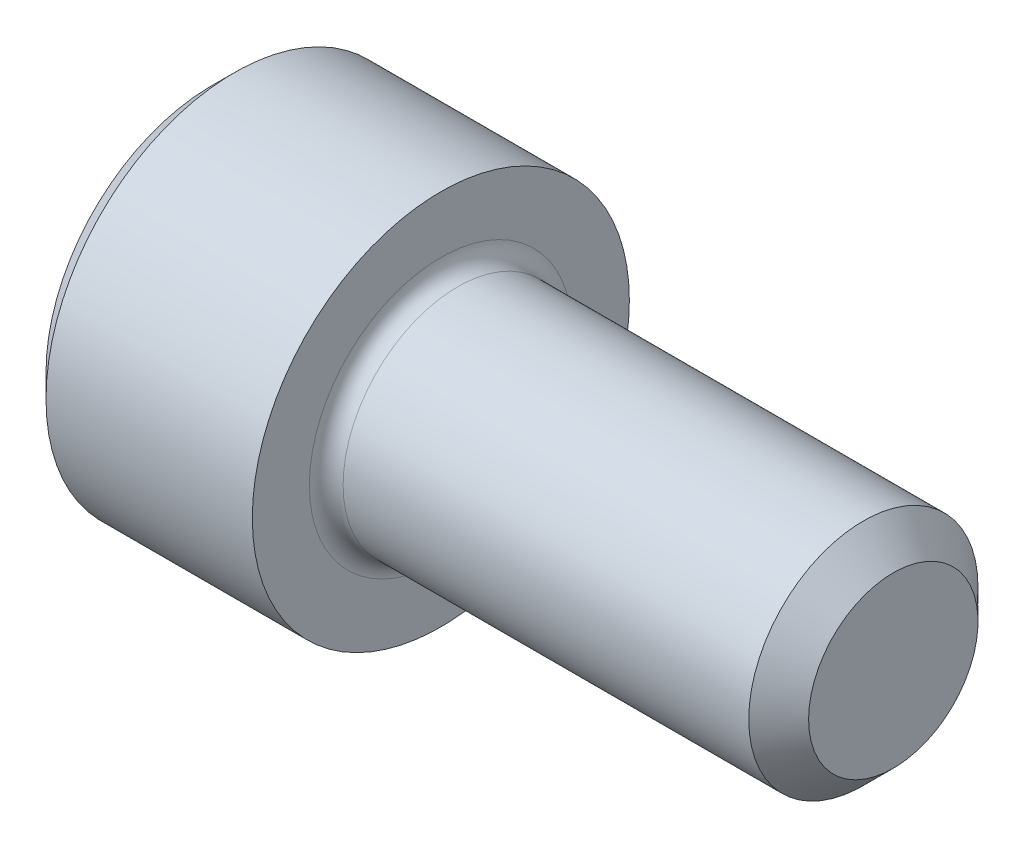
ISO-10303-21;
HEADER;
FILE_DESCRIPTION(('STEP AP214'),'2;1');
FILE_NAME('part.step','',(''),(''),'','','');
FILE_SCHEMA(('AUTOMOTIVE_DESIGN { 1 0 10303 214 1 1 1 1 }'));
ENDSEC;
DATA;
#1=APPLICATION_CONTEXT('core data for automotive mechanical design processes');
#2=APPLICATION_PROTOCOL_DEFINITION('international standard','automotive_design',2000,#1);
#3=PRODUCT_CONTEXT('',#1,'mechanical');
#4=PRODUCT('Part','Part','',(#3));
#5=PRODUCT_RELATED_PRODUCT_CATEGORY('part','',(#4));
#6=PRODUCT_DEFINITION_FORMATION('','',#4);
#7=PRODUCT_DEFINITION_CONTEXT('part definition',#1,'design');
#8=PRODUCT_DEFINITION('design','',#6,#7);
#9=PRODUCT_DEFINITION_SHAPE('','',#8);
#10=(LENGTH_UNIT() NAMED_UNIT(*) SI_UNIT(.MILLI.,.METRE.));
#11=(NAMED_UNIT(*) PLANE_ANGLE_UNIT() SI_UNIT($,.RADIAN.));
#12=(NAMED_UNIT(*) SI_UNIT($,.STERADIAN.) SOLID_ANGLE_UNIT());
#13=UNCERTAINTY_MEASURE_WITH_UNIT(LENGTH_MEASURE(1.E-05),#10,'distance_accuracy_value','');
#14=(GEOMETRIC_REPRESENTATION_CONTEXT(3) GLOBAL_UNCERTAINTY_ASSIGNED_CONTEXT((#13)) GLOBAL_UNIT_ASSIGNED_CONTEXT((#10,
#11,#12)) REPRESENTATION_CONTEXT('',''));
#15=CARTESIAN_POINT('',(0.,0.,0.));
#16=DIRECTION('',(0.,0.,1.));
#17=DIRECTION('',(1.,0.,0.));
#18=AXIS2_PLACEMENT_3D('',#15,#16,#17);
#19=CARTESIAN_POINT('',(0.,0.,0.));
#20=DIRECTION('',(-1.,0.,0.));
#21=DIRECTION('',(0.,0.,1.));
#22=AXIS2_PLACEMENT_3D('',#19,#20,#21);
#23=PLANE('',#22);
#24=DIRECTION('',(0.,-0.499999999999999,0.866025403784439));
#25=VECTOR('',#24,1.);
#26=CARTESIAN_POINT('',(0.,2.2920921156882,0.));
#27=LINE('',#26,#25);
#28=CARTESIAN_POINT('',(0.,2.2920921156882,0.));
#29=VERTEX_POINT('',#28);
#30=CARTESIAN_POINT('',(0.,1.14604605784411,1.98501));
#31=VERTEX_POINT('',#30);
#32=EDGE_CURVE('E113',#29,#31,#27,.T.);
#33=ORIENTED_EDGE('',*,*,#32,.T.);
#34=DIRECTION('',(0.,1.,0.));
#35=VECTOR('',#34,1.);
#36=CARTESIAN_POINT('',(0.,-1.14604605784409,1.98501));
#37=LINE('',#36,#35);
#38=CARTESIAN_POINT('',(0.,-1.14604605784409,1.98501));
#39=VERTEX_POINT('',#38);
#40=EDGE_CURVE('E102',#39,#31,#37,.T.);
#41=ORIENTED_EDGE('',*,*,#40,.F.);
#42=DIRECTION('',(0.,-0.500000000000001,-0.866025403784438));
#43=VECTOR('',#42,1.);
#44=CARTESIAN_POINT('',(0.,-1.14604605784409,1.98501));
#45=LINE('',#44,#43);
#46=CARTESIAN_POINT('',(0.,-2.29209211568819,0.));
#47=VERTEX_POINT('',#46);
#48=EDGE_CURVE('E112',#39,#47,#45,.T.);
#49=ORIENTED_EDGE('',*,*,#48,.T.);
#50=DIRECTION('',(0.,0.499999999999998,-0.86602540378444));
#51=VECTOR('',#50,1.);
#52=CARTESIAN_POINT('',(0.,-2.29209211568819,0.));
#53=LINE('',#52,#51);
#54=CARTESIAN_POINT('',(0.,-1.1460460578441,-1.98501));
#55=VERTEX_POINT('',#54);
#56=EDGE_CURVE('E131',#47,#55,#53,.T.);
#57=ORIENTED_EDGE('',*,*,#56,.T.);
#58=DIRECTION('',(0.,-1.,0.));
#59=VECTOR('',#58,1.);
#60=CARTESIAN_POINT('',(0.,1.1460460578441,-1.98501));
#61=LINE('',#60,#59);
#62=CARTESIAN_POINT('',(0.,1.1460460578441,-1.98501));
#63=VERTEX_POINT('',#62);
#64=EDGE_CURVE('E134',#63,#55,#61,.T.);
#65=ORIENTED_EDGE('',*,*,#64,.F.);
#66=DIRECTION('',(0.,-0.500000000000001,-0.866025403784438));
#67=VECTOR('',#66,1.);
#68=CARTESIAN_POINT('',(0.,2.2920921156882,0.));
#69=LINE('',#68,#67);
#70=EDGE_CURVE('E127',#29,#63,#69,.T.);
#71=ORIENTED_EDGE('',*,*,#70,.F.);
#72=EDGE_LOOP('',(#33,#41,#49,#57,#65,#71));
#73=FACE_BOUND('',#72,.T.);
#74=CARTESIAN_POINT('',(0.,0.,0.));
#75=DIRECTION('',(-1.,0.,0.));
#76=DIRECTION('',(0.,0.,1.));
#77=AXIS2_PLACEMENT_3D('',#74,#75,#76);
#78=CIRCLE('',#77,3.48614999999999);
#79=CARTESIAN_POINT('',(0.,0.,3.48614999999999));
#80=VERTEX_POINT('',#79);
#81=EDGE_CURVE('E172',#80,#80,#78,.T.);
#82=ORIENTED_EDGE('',*,*,#81,.T.);
#83=EDGE_LOOP('',(#82));
#84=FACE_BOUND('',#83,.T.);
#85=ADVANCED_FACE('F30',(#73,#84),#23,.T.);
#86=CARTESIAN_POINT('',(14.351,1.78308,0.));
#87=DIRECTION('',(1.,0.,0.));
#88=DIRECTION('',(0.,0.,-1.));
#89=AXIS2_PLACEMENT_3D('',#86,#87,#88);
#90=PLANE('',#89);
#91=CARTESIAN_POINT('',(14.351,0.,0.));
#92=DIRECTION('',(-1.,0.,0.));
#93=DIRECTION('',(0.,0.,1.));
#94=AXIS2_PLACEMENT_3D('',#91,#92,#93);
#95=CIRCLE('',#94,1.78308);
#96=CARTESIAN_POINT('',(14.351,0.,1.78308));
#97=VERTEX_POINT('',#96);
#98=EDGE_CURVE('E185',#97,#97,#95,.T.);
#99=ORIENTED_EDGE('',*,*,#98,.F.);
#100=EDGE_LOOP('',(#99));
#101=FACE_BOUND('',#100,.T.);
#102=ADVANCED_FACE('F32',(#101),#90,.T.);
#103=CARTESIAN_POINT('',(14.351,0.,0.));
#104=DIRECTION('',(-1.,0.,0.));
#105=DIRECTION('',(0.,0.,1.));
#106=AXIS2_PLACEMENT_3D('',#103,#104,#105);
#107=CONICAL_SURFACE('',#106,1.78308,0.785398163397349);
#108=CARTESIAN_POINT('',(13.7210799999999,0.,0.));
#109=DIRECTION('',(-1.,0.,0.));
#110=DIRECTION('',(0.,0.,1.));
#111=AXIS2_PLACEMENT_3D('',#108,#109,#110);
#112=CIRCLE('',#111,2.41299999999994);
#113=CARTESIAN_POINT('',(13.7210799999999,0.,2.41299999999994));
#114=VERTEX_POINT('',#113);
#115=EDGE_CURVE('E182',#114,#114,#112,.T.);
#116=ORIENTED_EDGE('',*,*,#115,.F.);
#117=EDGE_LOOP('',(#116));
#118=FACE_BOUND('',#117,.T.);
#119=ORIENTED_EDGE('',*,*,#98,.T.);
#120=EDGE_LOOP('',(#119));
#121=FACE_BOUND('',#120,.T.);
#122=ADVANCED_FACE('F213',(#118,#121),#107,.T.);
#123=CARTESIAN_POINT('',(-31.75,0.,0.));
#124=DIRECTION('',(-1.,0.,0.));
#125=DIRECTION('',(0.,0.,1.));
#126=AXIS2_PLACEMENT_3D('',#123,#124,#125);
#127=CYLINDRICAL_SURFACE('',#126,2.41299999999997);
#128=CARTESIAN_POINT('',(5.1816,0.,0.));
#129=DIRECTION('',(1.,0.,0.));
#130=DIRECTION('',(0.,0.,-1.));
#131=AXIS2_PLACEMENT_3D('',#128,#129,#130);
#132=CIRCLE('',#131,2.41299999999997);
#133=CARTESIAN_POINT('',(5.1816,0.,-2.41299999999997));
#134=VERTEX_POINT('',#133);
#135=EDGE_CURVE('E11',#134,#134,#132,.T.);
#136=ORIENTED_EDGE('',*,*,#135,.T.);
#137=EDGE_LOOP('',(#136));
#138=FACE_BOUND('',#137,.T.);
#139=ORIENTED_EDGE('',*,*,#115,.T.);
#140=EDGE_LOOP('',(#139));
#141=FACE_BOUND('',#140,.T.);
#142=ADVANCED_FACE('F221',(#138,#141),#127,.T.);
#143=CARTESIAN_POINT('',(4.826,3.96875,0.));
#144=DIRECTION('',(1.,0.,0.));
#145=DIRECTION('',(0.,0.,-1.));
#146=AXIS2_PLACEMENT_3D('',#143,#144,#145);
#147=PLANE('',#146);
#148=CARTESIAN_POINT('',(4.826,0.,0.));
#149=DIRECTION('',(1.,0.,0.));
#150=DIRECTION('',(0.,0.,-1.));
#151=AXIS2_PLACEMENT_3D('',#148,#149,#150);
#152=CIRCLE('',#151,2.76859999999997);
#153=CARTESIAN_POINT('',(4.826,0.,-2.76859999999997));
#154=VERTEX_POINT('',#153);
#155=EDGE_CURVE('E38',#154,#154,#152,.F.);
#156=ORIENTED_EDGE('',*,*,#155,.T.);
#157=EDGE_LOOP('',(#156));
#158=FACE_BOUND('',#157,.T.);
#159=CARTESIAN_POINT('',(4.826,0.,0.));
#160=DIRECTION('',(-1.,0.,0.));
#161=DIRECTION('',(0.,0.,1.));
#162=AXIS2_PLACEMENT_3D('',#159,#160,#161);
#163=CIRCLE('',#162,3.96875);
#164=CARTESIAN_POINT('',(4.826,0.,3.96875));
#165=VERTEX_POINT('',#164);
#166=EDGE_CURVE('E179',#165,#165,#163,.T.);
#167=ORIENTED_EDGE('',*,*,#166,.F.);
#168=EDGE_LOOP('',(#167));
#169=FACE_BOUND('',#168,.T.);
#170=ADVANCED_FACE('F190',(#158,#169),#147,.T.);
#171=CARTESIAN_POINT('',(-31.75,0.,0.));
#172=DIRECTION('',(-1.,0.,0.));
#173=DIRECTION('',(0.,0.,1.));
#174=AXIS2_PLACEMENT_3D('',#171,#172,#173);
#175=CYLINDRICAL_SURFACE('',#174,3.96875);
#176=ORIENTED_EDGE('',*,*,#166,.T.);
#177=EDGE_LOOP('',(#176));
#178=FACE_BOUND('',#177,.T.);
#179=CARTESIAN_POINT('',(0.4826,0.,0.));
#180=DIRECTION('',(-1.,0.,0.));
#181=DIRECTION('',(0.,0.,1.));
#182=AXIS2_PLACEMENT_3D('',#179,#180,#181);
#183=CIRCLE('',#182,3.96875);
#184=CARTESIAN_POINT('',(0.4826,0.,3.96875));
#185=VERTEX_POINT('',#184);
#186=EDGE_CURVE('E176',#185,#185,#183,.T.);
#187=ORIENTED_EDGE('',*,*,#186,.F.);
#188=EDGE_LOOP('',(#187));
#189=FACE_BOUND('',#188,.T.);
#190=ADVANCED_FACE('F203',(#178,#189),#175,.T.);
#191=CARTESIAN_POINT('',(0.,0.,0.));
#192=DIRECTION('',(1.,0.,0.));
#193=DIRECTION('',(0.,0.,-1.));
#194=AXIS2_PLACEMENT_3D('',#191,#192,#193);
#195=CONICAL_SURFACE('',#194,3.48614999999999,0.785398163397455);
#196=ORIENTED_EDGE('',*,*,#186,.T.);
#197=EDGE_LOOP('',(#196));
#198=FACE_BOUND('',#197,.T.);
#199=ORIENTED_EDGE('',*,*,#81,.F.);
#200=EDGE_LOOP('',(#199));
#201=FACE_BOUND('',#200,.T.);
#202=ADVANCED_FACE('F195',(#198,#201),#195,.T.);
#203=CARTESIAN_POINT('',(5.1816,0.,0.));
#204=DIRECTION('',(1.,0.,0.));
#205=DIRECTION('',(0.,0.,-1.));
#206=AXIS2_PLACEMENT_3D('',#203,#204,#205);
#207=TOROIDAL_SURFACE('',#206,2.76859999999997,0.3556);
#208=ORIENTED_EDGE('',*,*,#135,.F.);
#209=EDGE_LOOP('',(#208));
#210=FACE_BOUND('',#209,.T.);
#211=ORIENTED_EDGE('',*,*,#155,.F.);
#212=EDGE_LOOP('',(#211));
#213=FACE_BOUND('',#212,.T.);
#214=ADVANCED_FACE('F193',(#210,#213),#207,.F.);
#215=CARTESIAN_POINT('',(2.286,2.2920921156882,0.));
#216=DIRECTION('',(0.,-0.866025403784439,-0.499999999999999));
#217=DIRECTION('',(0.,0.499999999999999,-0.866025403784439));
#218=AXIS2_PLACEMENT_3D('',#215,#216,#217);
#219=PLANE('',#218);
#220=ORIENTED_EDGE('',*,*,#32,.F.);
#221=DIRECTION('',(-1.,0.,0.));
#222=VECTOR('',#221,1.);
#223=CARTESIAN_POINT('',(2.286,2.2920921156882,0.));
#224=LINE('',#223,#222);
#225=CARTESIAN_POINT('',(2.286,2.2920921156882,0.));
#226=VERTEX_POINT('',#225);
#227=EDGE_CURVE('E157',#226,#29,#224,.T.);
#228=ORIENTED_EDGE('',*,*,#227,.F.);
#229=DIRECTION('',(0.,-0.499999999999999,0.866025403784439));
#230=VECTOR('',#229,1.);
#231=CARTESIAN_POINT('',(2.286,2.2920921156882,0.));
#232=LINE('',#231,#230);
#233=CARTESIAN_POINT('',(2.286,1.71906908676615,0.992504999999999));
#234=VERTEX_POINT('',#233);
#235=EDGE_CURVE('E137',#226,#234,#232,.T.);
#236=ORIENTED_EDGE('',*,*,#235,.T.);
#237=CARTESIAN_POINT('',(2.286,1.14604605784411,1.98501));
#238=VERTEX_POINT('',#237);
#239=EDGE_CURVE('E121',#234,#238,#232,.T.);
#240=ORIENTED_EDGE('',*,*,#239,.T.);
#241=DIRECTION('',(-1.,0.,0.));
#242=VECTOR('',#241,1.);
#243=CARTESIAN_POINT('',(2.286,1.14604605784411,1.98501));
#244=LINE('',#243,#242);
#245=EDGE_CURVE('E106',#238,#31,#244,.T.);
#246=ORIENTED_EDGE('',*,*,#245,.T.);
#247=EDGE_LOOP('',(#220,#228,#236,#240,#246));
#248=FACE_BOUND('',#247,.T.);
#249=ADVANCED_FACE('F117',(#248),#219,.T.);
#250=CARTESIAN_POINT('',(2.286,-1.14604605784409,1.98501));
#251=DIRECTION('',(0.,0.,1.));
#252=DIRECTION('',(0.,-1.,0.));
#253=AXIS2_PLACEMENT_3D('',#250,#251,#252);
#254=PLANE('',#253);
#255=ORIENTED_EDGE('',*,*,#40,.T.);
#256=ORIENTED_EDGE('',*,*,#245,.F.);
#257=DIRECTION('',(0.,1.,0.));
#258=VECTOR('',#257,1.);
#259=CARTESIAN_POINT('',(2.286,-1.14604605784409,1.98501));
#260=LINE('',#259,#258);
#261=CARTESIAN_POINT('',(2.286,0.,1.98501));
#262=VERTEX_POINT('',#261);
#263=EDGE_CURVE('E139',#262,#238,#260,.T.);
#264=ORIENTED_EDGE('',*,*,#263,.F.);
#265=CARTESIAN_POINT('',(2.286,-1.14604605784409,1.98501));
#266=VERTEX_POINT('',#265);
#267=EDGE_CURVE('E140',#266,#262,#260,.T.);
#268=ORIENTED_EDGE('',*,*,#267,.F.);
#269=DIRECTION('',(-1.,0.,0.));
#270=VECTOR('',#269,1.);
#271=CARTESIAN_POINT('',(2.286,-1.14604605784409,1.98501));
#272=LINE('',#271,#270);
#273=EDGE_CURVE('E108',#266,#39,#272,.T.);
#274=ORIENTED_EDGE('',*,*,#273,.T.);
#275=EDGE_LOOP('',(#255,#256,#264,#268,#274));
#276=FACE_BOUND('',#275,.T.);
#277=ADVANCED_FACE('F104',(#276),#254,.F.);
#278=CARTESIAN_POINT('',(2.286,-1.14604605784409,1.98501));
#279=DIRECTION('',(0.,0.866025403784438,-0.500000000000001));
#280=DIRECTION('',(0.,0.500000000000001,0.866025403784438));
#281=AXIS2_PLACEMENT_3D('',#278,#279,#280);
#282=PLANE('',#281);
#283=ORIENTED_EDGE('',*,*,#48,.F.);
#284=ORIENTED_EDGE('',*,*,#273,.F.);
#285=DIRECTION('',(0.,-0.500000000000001,-0.866025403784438));
#286=VECTOR('',#285,1.);
#287=CARTESIAN_POINT('',(2.286,-1.14604605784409,1.98501));
#288=LINE('',#287,#286);
#289=CARTESIAN_POINT('',(2.286,-1.71906908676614,0.992504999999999));
#290=VERTEX_POINT('',#289);
#291=EDGE_CURVE('E144',#266,#290,#288,.T.);
#292=ORIENTED_EDGE('',*,*,#291,.T.);
#293=CARTESIAN_POINT('',(2.286,-2.29209211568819,0.));
#294=VERTEX_POINT('',#293);
#295=EDGE_CURVE('E143',#290,#294,#288,.T.);
#296=ORIENTED_EDGE('',*,*,#295,.T.);
#297=DIRECTION('',(-1.,0.,0.));
#298=VECTOR('',#297,1.);
#299=CARTESIAN_POINT('',(2.286,-2.29209211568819,0.));
#300=LINE('',#299,#298);
#301=EDGE_CURVE('E165',#294,#47,#300,.T.);
#302=ORIENTED_EDGE('',*,*,#301,.T.);
#303=EDGE_LOOP('',(#283,#284,#292,#296,#302));
#304=FACE_BOUND('',#303,.T.);
#305=ADVANCED_FACE('F284',(#304),#282,.T.);
#306=CARTESIAN_POINT('',(2.286,-2.29209211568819,0.));
#307=DIRECTION('',(0.,0.86602540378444,0.499999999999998));
#308=DIRECTION('',(0.,-0.499999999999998,0.86602540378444));
#309=AXIS2_PLACEMENT_3D('',#306,#307,#308);
#310=PLANE('',#309);
#311=ORIENTED_EDGE('',*,*,#56,.F.);
#312=ORIENTED_EDGE('',*,*,#301,.F.);
#313=DIRECTION('',(0.,0.499999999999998,-0.86602540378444));
#314=VECTOR('',#313,1.);
#315=CARTESIAN_POINT('',(2.286,-2.29209211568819,0.));
#316=LINE('',#315,#314);
#317=CARTESIAN_POINT('',(2.286,-1.71906908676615,-0.992504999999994));
#318=VERTEX_POINT('',#317);
#319=EDGE_CURVE('E148',#294,#318,#316,.T.);
#320=ORIENTED_EDGE('',*,*,#319,.T.);
#321=CARTESIAN_POINT('',(2.286,-1.1460460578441,-1.98501));
#322=VERTEX_POINT('',#321);
#323=EDGE_CURVE('E147',#318,#322,#316,.T.);
#324=ORIENTED_EDGE('',*,*,#323,.T.);
#325=DIRECTION('',(-1.,0.,0.));
#326=VECTOR('',#325,1.);
#327=CARTESIAN_POINT('',(2.286,-1.1460460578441,-1.98501));
#328=LINE('',#327,#326);
#329=EDGE_CURVE('E162',#322,#55,#328,.T.);
#330=ORIENTED_EDGE('',*,*,#329,.T.);
#331=EDGE_LOOP('',(#311,#312,#320,#324,#330));
#332=FACE_BOUND('',#331,.T.);
#333=ADVANCED_FACE('F292',(#332),#310,.T.);
#334=CARTESIAN_POINT('',(2.286,1.1460460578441,-1.98501));
#335=DIRECTION('',(0.,0.,-1.));
#336=DIRECTION('',(0.,1.,0.));
#337=AXIS2_PLACEMENT_3D('',#334,#335,#336);
#338=PLANE('',#337);
#339=ORIENTED_EDGE('',*,*,#64,.T.);
#340=ORIENTED_EDGE('',*,*,#329,.F.);
#341=DIRECTION('',(0.,-1.,0.));
#342=VECTOR('',#341,1.);
#343=CARTESIAN_POINT('',(2.286,1.1460460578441,-1.98501));
#344=LINE('',#343,#342);
#345=CARTESIAN_POINT('',(2.286,0.,-1.98501));
#346=VERTEX_POINT('',#345);
#347=EDGE_CURVE('E151',#346,#322,#344,.T.);
#348=ORIENTED_EDGE('',*,*,#347,.F.);
#349=CARTESIAN_POINT('',(2.286,1.1460460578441,-1.98501));
#350=VERTEX_POINT('',#349);
#351=EDGE_CURVE('E45',#350,#346,#344,.T.);
#352=ORIENTED_EDGE('',*,*,#351,.F.);
#353=DIRECTION('',(-1.,0.,0.));
#354=VECTOR('',#353,1.);
#355=CARTESIAN_POINT('',(2.286,1.1460460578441,-1.98501));
#356=LINE('',#355,#354);
#357=EDGE_CURVE('E159',#350,#63,#356,.T.);
#358=ORIENTED_EDGE('',*,*,#357,.T.);
#359=EDGE_LOOP('',(#339,#340,#348,#352,#358));
#360=FACE_BOUND('',#359,.T.);
#361=ADVANCED_FACE('F301',(#360),#338,.F.);
#362=CARTESIAN_POINT('',(2.286,2.2920921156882,0.));
#363=DIRECTION('',(0.,0.866025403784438,-0.500000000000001));
#364=DIRECTION('',(0.,0.500000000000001,0.866025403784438));
#365=AXIS2_PLACEMENT_3D('',#362,#363,#364);
#366=PLANE('',#365);
#367=ORIENTED_EDGE('',*,*,#70,.T.);
#368=ORIENTED_EDGE('',*,*,#357,.F.);
#369=DIRECTION('',(0.,-0.500000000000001,-0.866025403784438));
#370=VECTOR('',#369,1.);
#371=CARTESIAN_POINT('',(2.286,2.2920921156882,0.));
#372=LINE('',#371,#370);
#373=CARTESIAN_POINT('',(2.286,1.71906908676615,-0.992505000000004));
#374=VERTEX_POINT('',#373);
#375=EDGE_CURVE('E153',#374,#350,#372,.T.);
#376=ORIENTED_EDGE('',*,*,#375,.F.);
#377=EDGE_CURVE('E154',#226,#374,#372,.T.);
#378=ORIENTED_EDGE('',*,*,#377,.F.);
#379=ORIENTED_EDGE('',*,*,#227,.T.);
#380=EDGE_LOOP('',(#367,#368,#376,#378,#379));
#381=FACE_BOUND('',#380,.T.);
#382=ADVANCED_FACE('F310',(#381),#366,.F.);
#383=CARTESIAN_POINT('',(2.286,3.4381381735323,-1.98501));
#384=DIRECTION('',(1.,0.,0.));
#385=DIRECTION('',(0.,0.,-1.));
#386=AXIS2_PLACEMENT_3D('',#383,#384,#385);
#387=PLANE('',#386);
#388=ORIENTED_EDGE('',*,*,#347,.T.);
#389=ORIENTED_EDGE('',*,*,#323,.F.);
#390=CARTESIAN_POINT('',(2.286,0.,0.));
#391=DIRECTION('',(-1.,0.,0.));
#392=DIRECTION('',(0.,0.,1.));
#393=AXIS2_PLACEMENT_3D('',#390,#391,#392);
#394=CIRCLE('',#393,1.98501);
#395=EDGE_CURVE('E390',#346,#318,#394,.T.);
#396=ORIENTED_EDGE('',*,*,#395,.F.);
#397=EDGE_LOOP('',(#388,#389,#396));
#398=FACE_BOUND('',#397,.T.);
#399=ADVANCED_FACE('F319',(#398),#387,.F.);
#400=ORIENTED_EDGE('',*,*,#319,.F.);
#401=ORIENTED_EDGE('',*,*,#295,.F.);
#402=EDGE_CURVE('E393',#318,#290,#394,.T.);
#403=ORIENTED_EDGE('',*,*,#402,.F.);
#404=EDGE_LOOP('',(#400,#401,#403));
#405=FACE_BOUND('',#404,.T.);
#406=ADVANCED_FACE('F328',(#405),#387,.F.);
#407=ORIENTED_EDGE('',*,*,#291,.F.);
#408=ORIENTED_EDGE('',*,*,#267,.T.);
#409=EDGE_CURVE('E122',#290,#262,#394,.T.);
#410=ORIENTED_EDGE('',*,*,#409,.F.);
#411=EDGE_LOOP('',(#407,#408,#410));
#412=FACE_BOUND('',#411,.T.);
#413=ADVANCED_FACE('F337',(#412),#387,.F.);
#414=ORIENTED_EDGE('',*,*,#263,.T.);
#415=ORIENTED_EDGE('',*,*,#239,.F.);
#416=EDGE_CURVE('E169',#262,#234,#394,.T.);
#417=ORIENTED_EDGE('',*,*,#416,.F.);
#418=EDGE_LOOP('',(#414,#415,#417));
#419=FACE_BOUND('',#418,.T.);
#420=ADVANCED_FACE('F345',(#419),#387,.F.);
#421=ORIENTED_EDGE('',*,*,#235,.F.);
#422=ORIENTED_EDGE('',*,*,#377,.T.);
#423=EDGE_CURVE('E173',#234,#374,#394,.T.);
#424=ORIENTED_EDGE('',*,*,#423,.F.);
#425=EDGE_LOOP('',(#421,#422,#424));
#426=FACE_BOUND('',#425,.T.);
#427=ADVANCED_FACE('F353',(#426),#387,.F.);
#428=ORIENTED_EDGE('',*,*,#375,.T.);
#429=ORIENTED_EDGE('',*,*,#351,.T.);
#430=EDGE_CURVE('E383',#374,#346,#394,.T.);
#431=ORIENTED_EDGE('',*,*,#430,.F.);
#432=EDGE_LOOP('',(#428,#429,#431));
#433=FACE_BOUND('',#432,.T.);
#434=ADVANCED_FACE('F267',(#433),#387,.F.);
#435=CARTESIAN_POINT('',(2.286,0.,0.));
#436=DIRECTION('',(-1.,0.,0.));
#437=DIRECTION('',(0.,0.,1.));
#438=AXIS2_PLACEMENT_3D('',#435,#436,#437);
#439=CONICAL_SURFACE('',#438,1.98501,1.04719755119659);
#440=CARTESIAN_POINT('',(3.43204605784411,0.,0.));
#441=VERTEX_POINT('',#440);
#442=VERTEX_LOOP('',#441);
#443=FACE_BOUND('',#442,.T.);
#444=ORIENTED_EDGE('',*,*,#416,.T.);
#445=ORIENTED_EDGE('',*,*,#423,.T.);
#446=ORIENTED_EDGE('',*,*,#430,.T.);
#447=ORIENTED_EDGE('',*,*,#395,.T.);
#448=ORIENTED_EDGE('',*,*,#402,.T.);
#449=ORIENTED_EDGE('',*,*,#409,.T.);
#450=EDGE_LOOP('',(#444,#445,#446,#447,#448,#449));
#451=FACE_BOUND('',#450,.T.);
#452=ADVANCED_FACE('F261',(#443,#451),#439,.F.);
#453=CLOSED_SHELL('',(#85,#102,#122,#142,#170,#190,#202,#214,#249,#277,#305,#333,#361,#382,#399,
#406,#413,#420,#427,#434,#452));
#454=MANIFOLD_SOLID_BREP('B2',#453);
#455=ADVANCED_BREP_SHAPE_REPRESENTATION('',(#18,#454),#14);
#456=SHAPE_DEFINITION_REPRESENTATION(#9,#455);
ENDSEC;
END-ISO-10303-21;
